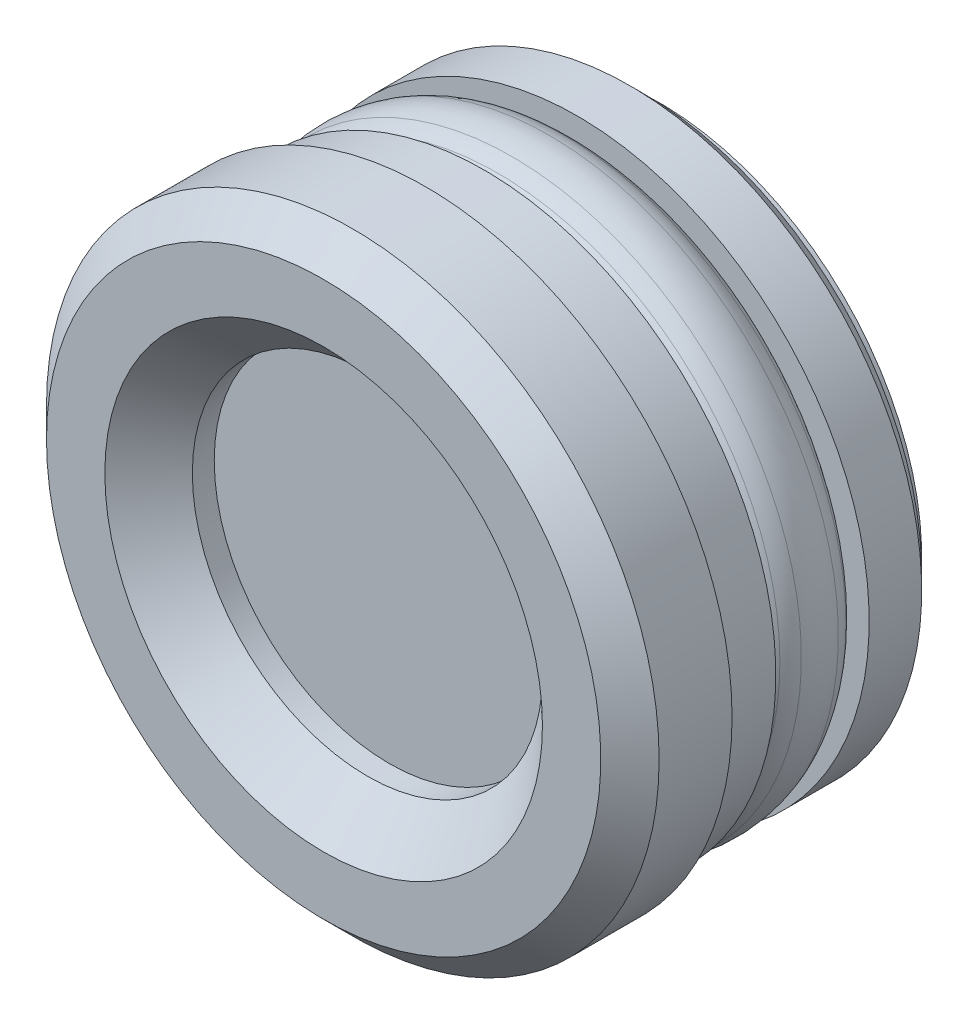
ISO-10303-21;
HEADER;
FILE_DESCRIPTION(('STEP AP214'),'2;1');
FILE_NAME('part.step','',(''),(''),'','','');
FILE_SCHEMA(('AUTOMOTIVE_DESIGN { 1 0 10303 214 1 1 1 1 }'));
ENDSEC;
DATA;
#1=APPLICATION_CONTEXT('core data for automotive mechanical design processes');
#2=APPLICATION_PROTOCOL_DEFINITION('international standard','automotive_design',2000,#1);
#3=PRODUCT_CONTEXT('',#1,'mechanical');
#4=PRODUCT('Part','Part','',(#3));
#5=PRODUCT_RELATED_PRODUCT_CATEGORY('part','',(#4));
#6=PRODUCT_DEFINITION_FORMATION('','',#4);
#7=PRODUCT_DEFINITION_CONTEXT('part definition',#1,'design');
#8=PRODUCT_DEFINITION('design','',#6,#7);
#9=PRODUCT_DEFINITION_SHAPE('','',#8);
#10=(LENGTH_UNIT() NAMED_UNIT(*) SI_UNIT(.MILLI.,.METRE.));
#11=(NAMED_UNIT(*) PLANE_ANGLE_UNIT() SI_UNIT($,.RADIAN.));
#12=(NAMED_UNIT(*) SI_UNIT($,.STERADIAN.) SOLID_ANGLE_UNIT());
#13=UNCERTAINTY_MEASURE_WITH_UNIT(LENGTH_MEASURE(1.E-05),#10,'distance_accuracy_value','');
#14=(GEOMETRIC_REPRESENTATION_CONTEXT(3) GLOBAL_UNCERTAINTY_ASSIGNED_CONTEXT((#13)) GLOBAL_UNIT_ASSIGNED_CONTEXT((#10,
#11,#12)) REPRESENTATION_CONTEXT('',''));
#15=CARTESIAN_POINT('',(0.,0.,0.));
#16=DIRECTION('',(0.,0.,1.));
#17=DIRECTION('',(1.,0.,0.));
#18=AXIS2_PLACEMENT_3D('',#15,#16,#17);
#19=CARTESIAN_POINT('',(0.,0.,-8.));
#20=DIRECTION('',(0.,0.,1.));
#21=DIRECTION('',(-1.,0.,0.));
#22=AXIS2_PLACEMENT_3D('',#19,#20,#21);
#23=PLANE('',#22);
#24=CARTESIAN_POINT('',(0.,0.,-8.));
#25=DIRECTION('',(0.,0.,1.));
#26=DIRECTION('',(-1.,0.,0.));
#27=AXIS2_PLACEMENT_3D('',#24,#25,#26);
#28=CIRCLE('',#27,9.);
#29=CARTESIAN_POINT('',(-9.,0.,-8.));
#30=VERTEX_POINT('',#29);
#31=EDGE_CURVE('E70',#30,#30,#28,.T.);
#32=ORIENTED_EDGE('',*,*,#31,.F.);
#33=EDGE_LOOP('',(#32));
#34=FACE_BOUND('',#33,.T.);
#35=ADVANCED_FACE('F12',(#34),#23,.F.);
#36=CARTESIAN_POINT('',(0.,0.,3.5));
#37=DIRECTION('',(0.,0.,1.));
#38=DIRECTION('',(-1.,0.,0.));
#39=AXIS2_PLACEMENT_3D('',#36,#37,#38);
#40=PLANE('',#39);
#41=CARTESIAN_POINT('',(0.,0.,3.5));
#42=DIRECTION('',(0.,0.,1.));
#43=DIRECTION('',(-1.,0.,0.));
#44=AXIS2_PLACEMENT_3D('',#41,#42,#43);
#45=CIRCLE('',#44,7.5);
#46=CARTESIAN_POINT('',(-7.5,0.,3.5));
#47=VERTEX_POINT('',#46);
#48=EDGE_CURVE('E73',#47,#47,#45,.T.);
#49=ORIENTED_EDGE('',*,*,#48,.F.);
#50=EDGE_LOOP('',(#49));
#51=FACE_BOUND('',#50,.T.);
#52=CARTESIAN_POINT('',(0.,0.,3.5));
#53=DIRECTION('',(0.,0.,1.));
#54=DIRECTION('',(-1.,0.,0.));
#55=AXIS2_PLACEMENT_3D('',#52,#53,#54);
#56=CIRCLE('',#55,9.5);
#57=CARTESIAN_POINT('',(-9.5,0.,3.5));
#58=VERTEX_POINT('',#57);
#59=EDGE_CURVE('E8',#58,#58,#56,.T.);
#60=ORIENTED_EDGE('',*,*,#59,.T.);
#61=EDGE_LOOP('',(#60));
#62=FACE_BOUND('',#61,.T.);
#63=ADVANCED_FACE('F93',(#51,#62),#40,.T.);
#64=CARTESIAN_POINT('',(0.,0.,3.5));
#65=DIRECTION('',(0.,0.,-1.));
#66=DIRECTION('',(1.,0.,0.));
#67=AXIS2_PLACEMENT_3D('',#64,#65,#66);
#68=CONICAL_SURFACE('',#67,9.5,0.785398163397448);
#69=CARTESIAN_POINT('',(0.,0.,2.5));
#70=DIRECTION('',(0.,0.,1.));
#71=DIRECTION('',(-1.,0.,0.));
#72=AXIS2_PLACEMENT_3D('',#69,#70,#71);
#73=CIRCLE('',#72,10.5);
#74=CARTESIAN_POINT('',(-10.5,0.,2.5));
#75=VERTEX_POINT('',#74);
#76=EDGE_CURVE('E18',#75,#75,#73,.T.);
#77=ORIENTED_EDGE('',*,*,#76,.T.);
#78=EDGE_LOOP('',(#77));
#79=FACE_BOUND('',#78,.T.);
#80=ORIENTED_EDGE('',*,*,#59,.F.);
#81=EDGE_LOOP('',(#80));
#82=FACE_BOUND('',#81,.T.);
#83=ADVANCED_FACE('F95',(#79,#82),#68,.T.);
#84=CARTESIAN_POINT('',(0.,0.,7.1447695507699));
#85=DIRECTION('',(0.,0.,1.));
#86=DIRECTION('',(-1.,0.,0.));
#87=AXIS2_PLACEMENT_3D('',#84,#85,#86);
#88=CYLINDRICAL_SURFACE('',#87,10.5);
#89=CARTESIAN_POINT('',(0.,0.,0.));
#90=DIRECTION('',(0.,0.,1.));
#91=DIRECTION('',(-1.,0.,0.));
#92=AXIS2_PLACEMENT_3D('',#89,#90,#91);
#93=CIRCLE('',#92,10.5);
#94=CARTESIAN_POINT('',(-10.5,0.,0.));
#95=VERTEX_POINT('',#94);
#96=EDGE_CURVE('E22',#95,#95,#93,.T.);
#97=ORIENTED_EDGE('',*,*,#96,.T.);
#98=EDGE_LOOP('',(#97));
#99=FACE_BOUND('',#98,.T.);
#100=ORIENTED_EDGE('',*,*,#76,.F.);
#101=EDGE_LOOP('',(#100));
#102=FACE_BOUND('',#101,.T.);
#103=ADVANCED_FACE('F102',(#99,#102),#88,.T.);
#104=CARTESIAN_POINT('',(0.,-10.,0.));
#105=DIRECTION('',(0.,0.,1.));
#106=DIRECTION('',(-1.,0.,0.));
#107=AXIS2_PLACEMENT_3D('',#104,#105,#106);
#108=PLANE('',#107);
#109=ORIENTED_EDGE('',*,*,#96,.F.);
#110=EDGE_LOOP('',(#109));
#111=FACE_BOUND('',#110,.T.);
#112=CARTESIAN_POINT('',(0.,0.,0.));
#113=DIRECTION('',(0.,0.,1.));
#114=DIRECTION('',(-1.,0.,0.));
#115=AXIS2_PLACEMENT_3D('',#112,#113,#114);
#116=CIRCLE('',#115,10.);
#117=CARTESIAN_POINT('',(-10.,0.,0.));
#118=VERTEX_POINT('',#117);
#119=EDGE_CURVE('E26',#118,#118,#116,.T.);
#120=ORIENTED_EDGE('',*,*,#119,.T.);
#121=EDGE_LOOP('',(#120));
#122=FACE_BOUND('',#121,.T.);
#123=ADVANCED_FACE('F108',(#111,#122),#108,.F.);
#124=CARTESIAN_POINT('',(0.,0.,7.1447695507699));
#125=DIRECTION('',(0.,0.,1.));
#126=DIRECTION('',(-1.,0.,0.));
#127=AXIS2_PLACEMENT_3D('',#124,#125,#126);
#128=CYLINDRICAL_SURFACE('',#127,10.);
#129=ORIENTED_EDGE('',*,*,#119,.F.);
#130=EDGE_LOOP('',(#129));
#131=FACE_BOUND('',#130,.T.);
#132=CARTESIAN_POINT('',(0.,0.,-2.));
#133=DIRECTION('',(0.,0.,1.));
#134=DIRECTION('',(-1.,0.,0.));
#135=AXIS2_PLACEMENT_3D('',#132,#133,#134);
#136=CIRCLE('',#135,10.);
#137=CARTESIAN_POINT('',(-10.,0.,-2.));
#138=VERTEX_POINT('',#137);
#139=EDGE_CURVE('E31',#138,#138,#136,.T.);
#140=ORIENTED_EDGE('',*,*,#139,.T.);
#141=EDGE_LOOP('',(#140));
#142=FACE_BOUND('',#141,.T.);
#143=ADVANCED_FACE('F112',(#131,#142),#128,.T.);
#144=CARTESIAN_POINT('',(0.,-8.875,-1.9999999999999));
#145=DIRECTION('',(0.,0.,1.));
#146=DIRECTION('',(-1.,0.,0.));
#147=AXIS2_PLACEMENT_3D('',#144,#145,#146);
#148=PLANE('',#147);
#149=ORIENTED_EDGE('',*,*,#139,.F.);
#150=EDGE_LOOP('',(#149));
#151=FACE_BOUND('',#150,.T.);
#152=CARTESIAN_POINT('',(0.,0.,-1.9999999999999));
#153=DIRECTION('',(0.,0.,1.));
#154=DIRECTION('',(-1.,0.,0.));
#155=AXIS2_PLACEMENT_3D('',#152,#153,#154);
#156=CIRCLE('',#155,8.875);
#157=CARTESIAN_POINT('',(-8.875,0.,-1.9999999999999));
#158=VERTEX_POINT('',#157);
#159=EDGE_CURVE('E34',#158,#158,#156,.T.);
#160=ORIENTED_EDGE('',*,*,#159,.T.);
#161=EDGE_LOOP('',(#160));
#162=FACE_BOUND('',#161,.T.);
#163=ADVANCED_FACE('F116',(#151,#162),#148,.F.);
#164=CARTESIAN_POINT('',(0.,0.,-2.80419839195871));
#165=DIRECTION('',(0.,0.,1.));
#166=DIRECTION('',(-1.,0.,0.));
#167=AXIS2_PLACEMENT_3D('',#164,#165,#166);
#168=TOROIDAL_SURFACE('',#167,8.875,0.80419839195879);
#169=CARTESIAN_POINT('',(0.,0.,-2.11129539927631));
#170=DIRECTION('',(0.,0.,1.));
#171=DIRECTION('',(-1.,0.,0.));
#172=AXIS2_PLACEMENT_3D('',#169,#170,#171);
#173=CIRCLE('',#172,9.28319173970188);
#174=CARTESIAN_POINT('',(-9.28319173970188,0.,-2.11129539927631));
#175=VERTEX_POINT('',#174);
#176=EDGE_CURVE('E37',#175,#175,#173,.T.);
#177=ORIENTED_EDGE('',*,*,#176,.T.);
#178=EDGE_LOOP('',(#177));
#179=FACE_BOUND('',#178,.T.);
#180=ORIENTED_EDGE('',*,*,#159,.F.);
#181=EDGE_LOOP('',(#180));
#182=FACE_BOUND('',#181,.T.);
#183=ADVANCED_FACE('F120',(#179,#182),#168,.T.);
#184=CARTESIAN_POINT('',(0.,0.,-3.18618618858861));
#185=DIRECTION('',(0.,0.,1.));
#186=DIRECTION('',(-1.,0.,0.));
#187=AXIS2_PLACEMENT_3D('',#184,#185,#186);
#188=TOROIDAL_SURFACE('',#187,8.64996956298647,1.24754179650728);
#189=CARTESIAN_POINT('',(0.,0.,-2.4686291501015));
#190=DIRECTION('',(0.,0.,1.));
#191=DIRECTION('',(-1.,0.,0.));
#192=AXIS2_PLACEMENT_3D('',#189,#190,#191);
#193=CIRCLE('',#192,9.67049512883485);
#194=CARTESIAN_POINT('',(-9.67049512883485,0.,-2.4686291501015));
#195=VERTEX_POINT('',#194);
#196=EDGE_CURVE('E40',#195,#195,#193,.T.);
#197=ORIENTED_EDGE('',*,*,#196,.T.);
#198=EDGE_LOOP('',(#197));
#199=FACE_BOUND('',#198,.T.);
#200=ORIENTED_EDGE('',*,*,#176,.F.);
#201=EDGE_LOOP('',(#200));
#202=FACE_BOUND('',#201,.T.);
#203=ADVANCED_FACE('F124',(#199,#202),#188,.T.);
#204=CARTESIAN_POINT('',(0.,0.,-3.4363346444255));
#205=DIRECTION('',(0.,0.,1.));
#206=DIRECTION('',(-1.,0.,0.));
#207=AXIS2_PLACEMENT_3D('',#204,#205,#206);
#208=TOROIDAL_SURFACE('',#207,8.2942028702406,1.68244890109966);
#209=CARTESIAN_POINT('',(0.,0.,-2.9658783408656));
#210=DIRECTION('',(0.,0.,1.));
#211=DIRECTION('',(-1.,0.,0.));
#212=AXIS2_PLACEMENT_3D('',#209,#210,#211);
#213=CIRCLE('',#212,9.90953725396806);
#214=CARTESIAN_POINT('',(-9.90953725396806,0.,-2.9658783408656));
#215=VERTEX_POINT('',#214);
#216=EDGE_CURVE('E43',#215,#215,#213,.T.);
#217=ORIENTED_EDGE('',*,*,#216,.T.);
#218=EDGE_LOOP('',(#217));
#219=FACE_BOUND('',#218,.T.);
#220=ORIENTED_EDGE('',*,*,#196,.F.);
#221=EDGE_LOOP('',(#220));
#222=FACE_BOUND('',#221,.T.);
#223=ADVANCED_FACE('F128',(#219,#222),#208,.T.);
#224=CARTESIAN_POINT('',(0.,0.,-3.59999999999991));
#225=DIRECTION('',(0.,0.,1.));
#226=DIRECTION('',(-1.,0.,0.));
#227=AXIS2_PLACEMENT_3D('',#224,#225,#226);
#228=TOROIDAL_SURFACE('',#227,7.73224998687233,2.26775001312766);
#229=CARTESIAN_POINT('',(0.,0.,-4.23412165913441));
#230=DIRECTION('',(0.,0.,1.));
#231=DIRECTION('',(-1.,0.,0.));
#232=AXIS2_PLACEMENT_3D('',#229,#230,#231);
#233=CIRCLE('',#232,9.90953725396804);
#234=CARTESIAN_POINT('',(-9.90953725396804,0.,-4.23412165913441));
#235=VERTEX_POINT('',#234);
#236=EDGE_CURVE('E46',#235,#235,#233,.T.);
#237=ORIENTED_EDGE('',*,*,#236,.T.);
#238=EDGE_LOOP('',(#237));
#239=FACE_BOUND('',#238,.T.);
#240=ORIENTED_EDGE('',*,*,#216,.F.);
#241=EDGE_LOOP('',(#240));
#242=FACE_BOUND('',#241,.T.);
#243=ADVANCED_FACE('F132',(#239,#242),#228,.T.);
#244=CARTESIAN_POINT('',(0.,0.,-3.76366535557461));
#245=DIRECTION('',(0.,0.,1.));
#246=DIRECTION('',(-1.,0.,0.));
#247=AXIS2_PLACEMENT_3D('',#244,#245,#246);
#248=TOROIDAL_SURFACE('',#247,8.29420287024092,1.68244890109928);
#249=CARTESIAN_POINT('',(0.,0.,-4.73137084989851));
#250=DIRECTION('',(0.,0.,1.));
#251=DIRECTION('',(-1.,0.,0.));
#252=AXIS2_PLACEMENT_3D('',#249,#250,#251);
#253=CIRCLE('',#252,9.67049512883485);
#254=CARTESIAN_POINT('',(-9.67049512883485,0.,-4.73137084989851));
#255=VERTEX_POINT('',#254);
#256=EDGE_CURVE('E49',#255,#255,#253,.T.);
#257=ORIENTED_EDGE('',*,*,#256,.T.);
#258=EDGE_LOOP('',(#257));
#259=FACE_BOUND('',#258,.T.);
#260=ORIENTED_EDGE('',*,*,#236,.F.);
#261=EDGE_LOOP('',(#260));
#262=FACE_BOUND('',#261,.T.);
#263=ADVANCED_FACE('F136',(#259,#262),#248,.T.);
#264=CARTESIAN_POINT('',(0.,0.,-4.01381381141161));
#265=DIRECTION('',(0.,0.,1.));
#266=DIRECTION('',(-1.,0.,0.));
#267=AXIS2_PLACEMENT_3D('',#264,#265,#266);
#268=TOROIDAL_SURFACE('',#267,8.64996956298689,1.24754179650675);
#269=CARTESIAN_POINT('',(0.,0.,-5.08870460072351));
#270=DIRECTION('',(0.,0.,1.));
#271=DIRECTION('',(-1.,0.,0.));
#272=AXIS2_PLACEMENT_3D('',#269,#270,#271);
#273=CIRCLE('',#272,9.28319173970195);
#274=CARTESIAN_POINT('',(-9.28319173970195,0.,-5.08870460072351));
#275=VERTEX_POINT('',#274);
#276=EDGE_CURVE('E52',#275,#275,#273,.T.);
#277=ORIENTED_EDGE('',*,*,#276,.T.);
#278=EDGE_LOOP('',(#277));
#279=FACE_BOUND('',#278,.T.);
#280=ORIENTED_EDGE('',*,*,#256,.F.);
#281=EDGE_LOOP('',(#280));
#282=FACE_BOUND('',#281,.T.);
#283=ADVANCED_FACE('F140',(#279,#282),#268,.T.);
#284=CARTESIAN_POINT('',(0.,0.,-4.39580160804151));
#285=DIRECTION('',(0.,0.,1.));
#286=DIRECTION('',(-1.,0.,0.));
#287=AXIS2_PLACEMENT_3D('',#284,#285,#286);
#288=TOROIDAL_SURFACE('',#287,8.875,0.804198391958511);
#289=CARTESIAN_POINT('',(0.,0.,-5.2));
#290=DIRECTION('',(0.,0.,1.));
#291=DIRECTION('',(-1.,0.,0.));
#292=AXIS2_PLACEMENT_3D('',#289,#290,#291);
#293=CIRCLE('',#292,8.875);
#294=CARTESIAN_POINT('',(-8.875,0.,-5.2));
#295=VERTEX_POINT('',#294);
#296=EDGE_CURVE('E55',#295,#295,#293,.T.);
#297=ORIENTED_EDGE('',*,*,#296,.T.);
#298=EDGE_LOOP('',(#297));
#299=FACE_BOUND('',#298,.T.);
#300=ORIENTED_EDGE('',*,*,#276,.F.);
#301=EDGE_LOOP('',(#300));
#302=FACE_BOUND('',#301,.T.);
#303=ADVANCED_FACE('F144',(#299,#302),#288,.T.);
#304=CARTESIAN_POINT('',(0.,-8.875,-5.2));
#305=DIRECTION('',(0.,0.,1.));
#306=DIRECTION('',(-1.,0.,0.));
#307=AXIS2_PLACEMENT_3D('',#304,#305,#306);
#308=PLANE('',#307);
#309=CARTESIAN_POINT('',(0.,0.,-5.2));
#310=DIRECTION('',(0.,0.,1.));
#311=DIRECTION('',(-1.,0.,0.));
#312=AXIS2_PLACEMENT_3D('',#309,#310,#311);
#313=CIRCLE('',#312,10.0000000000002);
#314=CARTESIAN_POINT('',(-10.0000000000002,0.,-5.2));
#315=VERTEX_POINT('',#314);
#316=EDGE_CURVE('E58',#315,#315,#313,.T.);
#317=ORIENTED_EDGE('',*,*,#316,.T.);
#318=EDGE_LOOP('',(#317));
#319=FACE_BOUND('',#318,.T.);
#320=ORIENTED_EDGE('',*,*,#296,.F.);
#321=EDGE_LOOP('',(#320));
#322=FACE_BOUND('',#321,.T.);
#323=ADVANCED_FACE('F148',(#319,#322),#308,.T.);
#324=CARTESIAN_POINT('',(0.,0.,7.1447695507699));
#325=DIRECTION('',(0.,0.,1.));
#326=DIRECTION('',(-1.,0.,0.));
#327=AXIS2_PLACEMENT_3D('',#324,#325,#326);
#328=CYLINDRICAL_SURFACE('',#327,10.);
#329=ORIENTED_EDGE('',*,*,#316,.F.);
#330=EDGE_LOOP('',(#329));
#331=FACE_BOUND('',#330,.T.);
#332=CARTESIAN_POINT('',(0.,0.,-7.));
#333=DIRECTION('',(0.,0.,1.));
#334=DIRECTION('',(-1.,0.,0.));
#335=AXIS2_PLACEMENT_3D('',#332,#333,#334);
#336=CIRCLE('',#335,10.);
#337=CARTESIAN_POINT('',(-10.,0.,-7.));
#338=VERTEX_POINT('',#337);
#339=EDGE_CURVE('E61',#338,#338,#336,.T.);
#340=ORIENTED_EDGE('',*,*,#339,.T.);
#341=EDGE_LOOP('',(#340));
#342=FACE_BOUND('',#341,.T.);
#343=ADVANCED_FACE('F152',(#331,#342),#328,.T.);
#344=CARTESIAN_POINT('',(0.,0.,-7.5));
#345=DIRECTION('',(0.,0.,1.));
#346=DIRECTION('',(-1.,0.,0.));
#347=AXIS2_PLACEMENT_3D('',#344,#345,#346);
#348=CONICAL_SURFACE('',#347,9.5,0.785398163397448);
#349=ORIENTED_EDGE('',*,*,#339,.F.);
#350=EDGE_LOOP('',(#349));
#351=FACE_BOUND('',#350,.T.);
#352=CARTESIAN_POINT('',(0.,0.,-7.5));
#353=DIRECTION('',(0.,0.,1.));
#354=DIRECTION('',(-1.,0.,0.));
#355=AXIS2_PLACEMENT_3D('',#352,#353,#354);
#356=CIRCLE('',#355,9.5);
#357=CARTESIAN_POINT('',(-9.5,0.,-7.5));
#358=VERTEX_POINT('',#357);
#359=EDGE_CURVE('E64',#358,#358,#356,.T.);
#360=ORIENTED_EDGE('',*,*,#359,.T.);
#361=EDGE_LOOP('',(#360));
#362=FACE_BOUND('',#361,.T.);
#363=ADVANCED_FACE('F156',(#351,#362),#348,.T.);
#364=CARTESIAN_POINT('',(0.,-9.,-7.5));
#365=DIRECTION('',(0.,0.,1.));
#366=DIRECTION('',(-1.,0.,0.));
#367=AXIS2_PLACEMENT_3D('',#364,#365,#366);
#368=PLANE('',#367);
#369=ORIENTED_EDGE('',*,*,#359,.F.);
#370=EDGE_LOOP('',(#369));
#371=FACE_BOUND('',#370,.T.);
#372=CARTESIAN_POINT('',(0.,0.,-7.5));
#373=DIRECTION('',(0.,0.,1.));
#374=DIRECTION('',(-1.,0.,0.));
#375=AXIS2_PLACEMENT_3D('',#372,#373,#374);
#376=CIRCLE('',#375,9.);
#377=CARTESIAN_POINT('',(-9.,0.,-7.5));
#378=VERTEX_POINT('',#377);
#379=EDGE_CURVE('E67',#378,#378,#376,.T.);
#380=ORIENTED_EDGE('',*,*,#379,.T.);
#381=EDGE_LOOP('',(#380));
#382=FACE_BOUND('',#381,.T.);
#383=ADVANCED_FACE('F160',(#371,#382),#368,.F.);
#384=CARTESIAN_POINT('',(0.,0.,7.1447695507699));
#385=DIRECTION('',(0.,0.,1.));
#386=DIRECTION('',(-1.,0.,0.));
#387=AXIS2_PLACEMENT_3D('',#384,#385,#386);
#388=CYLINDRICAL_SURFACE('',#387,9.);
#389=ORIENTED_EDGE('',*,*,#379,.F.);
#390=EDGE_LOOP('',(#389));
#391=FACE_BOUND('',#390,.T.);
#392=ORIENTED_EDGE('',*,*,#31,.T.);
#393=EDGE_LOOP('',(#392));
#394=FACE_BOUND('',#393,.T.);
#395=ADVANCED_FACE('F89',(#391,#394),#388,.T.);
#396=CARTESIAN_POINT('',(0.,0.,3.5));
#397=DIRECTION('',(0.,0.,1.));
#398=DIRECTION('',(-1.,0.,0.));
#399=AXIS2_PLACEMENT_3D('',#396,#397,#398);
#400=CONICAL_SURFACE('',#399,7.5,0.785398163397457);
#401=CARTESIAN_POINT('',(0.,0.,2.));
#402=DIRECTION('',(0.,0.,1.));
#403=DIRECTION('',(-1.,0.,0.));
#404=AXIS2_PLACEMENT_3D('',#401,#402,#403);
#405=CIRCLE('',#404,6.);
#406=CARTESIAN_POINT('',(-6.,0.,2.));
#407=VERTEX_POINT('',#406);
#408=EDGE_CURVE('E79',#407,#407,#405,.T.);
#409=ORIENTED_EDGE('',*,*,#408,.F.);
#410=EDGE_LOOP('',(#409));
#411=FACE_BOUND('',#410,.T.);
#412=ORIENTED_EDGE('',*,*,#48,.T.);
#413=EDGE_LOOP('',(#412));
#414=FACE_BOUND('',#413,.T.);
#415=ADVANCED_FACE('F85',(#411,#414),#400,.F.);
#416=CARTESIAN_POINT('',(0.,-6.,1.24999999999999));
#417=DIRECTION('',(0.,0.,-1.));
#418=DIRECTION('',(1.,0.,0.));
#419=AXIS2_PLACEMENT_3D('',#416,#417,#418);
#420=PLANE('',#419);
#421=CARTESIAN_POINT('',(0.,0.,1.24999999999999));
#422=DIRECTION('',(0.,0.,1.));
#423=DIRECTION('',(-1.,0.,0.));
#424=AXIS2_PLACEMENT_3D('',#421,#422,#423);
#425=CIRCLE('',#424,6.);
#426=CARTESIAN_POINT('',(-6.,0.,1.24999999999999));
#427=VERTEX_POINT('',#426);
#428=EDGE_CURVE('E76',#427,#427,#425,.T.);
#429=ORIENTED_EDGE('',*,*,#428,.T.);
#430=EDGE_LOOP('',(#429));
#431=FACE_BOUND('',#430,.T.);
#432=ADVANCED_FACE('F88',(#431),#420,.F.);
#433=CARTESIAN_POINT('',(0.,0.,7.1447695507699));
#434=DIRECTION('',(0.,0.,1.));
#435=DIRECTION('',(-1.,0.,0.));
#436=AXIS2_PLACEMENT_3D('',#433,#434,#435);
#437=CYLINDRICAL_SURFACE('',#436,6.);
#438=ORIENTED_EDGE('',*,*,#428,.F.);
#439=EDGE_LOOP('',(#438));
#440=FACE_BOUND('',#439,.T.);
#441=ORIENTED_EDGE('',*,*,#408,.T.);
#442=EDGE_LOOP('',(#441));
#443=FACE_BOUND('',#442,.T.);
#444=ADVANCED_FACE('F83',(#440,#443),#437,.F.);
#445=CLOSED_SHELL('',(#35,#63,#83,#103,#123,#143,#163,#183,#203,#223,#243,#263,#283,#303,#323,
#343,#363,#383,#395,#415,#432,#444));
#446=MANIFOLD_SOLID_BREP('B1',#445);
#447=ADVANCED_BREP_SHAPE_REPRESENTATION('',(#18,#446),#14);
#448=SHAPE_DEFINITION_REPRESENTATION(#9,#447);
ENDSEC;
END-ISO-10303-21;
